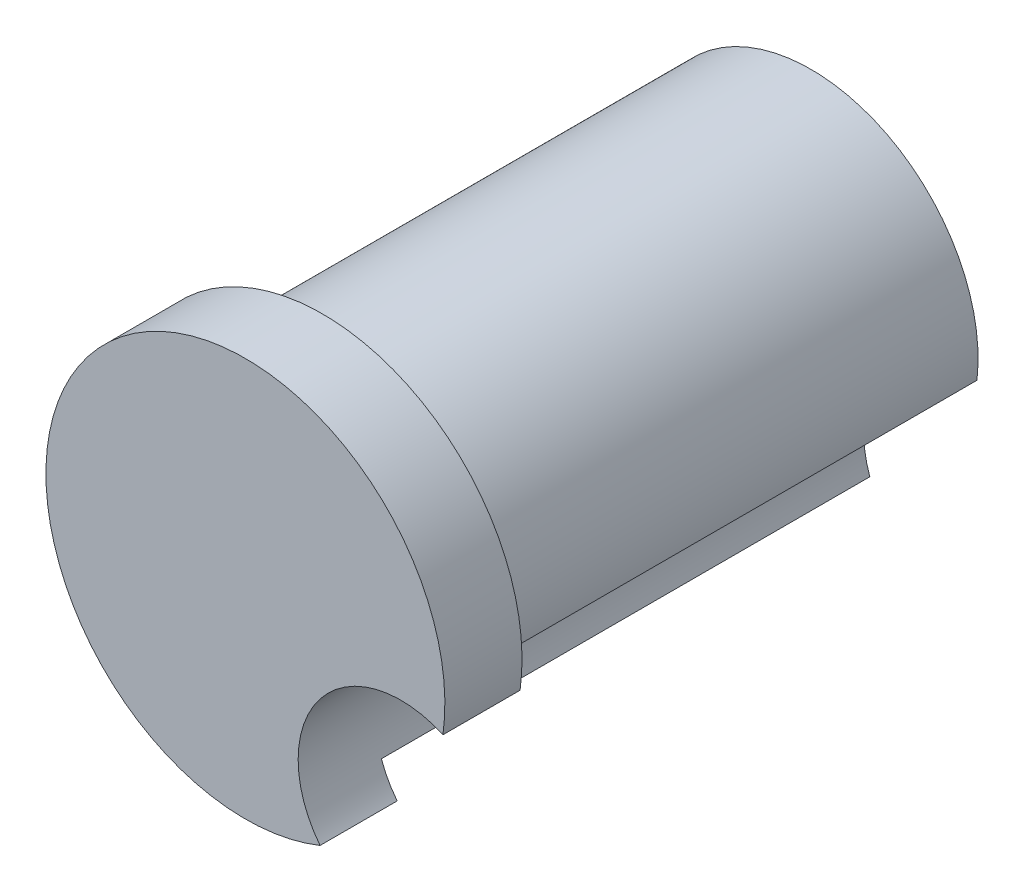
ISO-10303-21;
HEADER;
FILE_DESCRIPTION(('STEP AP214'),'2;1');
FILE_NAME('part.step','',(''),(''),'','','');
FILE_SCHEMA(('AUTOMOTIVE_DESIGN { 1 0 10303 214 1 1 1 1 }'));
ENDSEC;
DATA;
#1=APPLICATION_CONTEXT('core data for automotive mechanical design processes');
#2=APPLICATION_PROTOCOL_DEFINITION('international standard','automotive_design',2000,#1);
#3=PRODUCT_CONTEXT('',#1,'mechanical');
#4=PRODUCT('Part','Part','',(#3));
#5=PRODUCT_RELATED_PRODUCT_CATEGORY('part','',(#4));
#6=PRODUCT_DEFINITION_FORMATION('','',#4);
#7=PRODUCT_DEFINITION_CONTEXT('part definition',#1,'design');
#8=PRODUCT_DEFINITION('design','',#6,#7);
#9=PRODUCT_DEFINITION_SHAPE('','',#8);
#10=(LENGTH_UNIT() NAMED_UNIT(*) SI_UNIT(.MILLI.,.METRE.));
#11=(NAMED_UNIT(*) PLANE_ANGLE_UNIT() SI_UNIT($,.RADIAN.));
#12=(NAMED_UNIT(*) SI_UNIT($,.STERADIAN.) SOLID_ANGLE_UNIT());
#13=UNCERTAINTY_MEASURE_WITH_UNIT(LENGTH_MEASURE(1.E-05),#10,'distance_accuracy_value','');
#14=(GEOMETRIC_REPRESENTATION_CONTEXT(3) GLOBAL_UNCERTAINTY_ASSIGNED_CONTEXT((#13)) GLOBAL_UNIT_ASSIGNED_CONTEXT((#10,
#11,#12)) REPRESENTATION_CONTEXT('',''));
#15=CARTESIAN_POINT('',(0.,0.,0.));
#16=DIRECTION('',(0.,0.,1.));
#17=DIRECTION('',(1.,0.,0.));
#18=AXIS2_PLACEMENT_3D('',#15,#16,#17);
#19=CARTESIAN_POINT('',(10.31875,0.,0.));
#20=DIRECTION('',(0.,0.,-1.));
#21=DIRECTION('',(-1.,0.,0.));
#22=AXIS2_PLACEMENT_3D('',#19,#20,#21);
#23=PLANE('',#22);
#24=CARTESIAN_POINT('',(9.60742710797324,-7.50614470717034,0.));
#25=DIRECTION('',(0.,0.,-1.));
#26=DIRECTION('',(-1.,0.,0.));
#27=AXIS2_PLACEMENT_3D('',#24,#25,#26);
#28=CIRCLE('',#27,6.35);
#29=CARTESIAN_POINT('',(3.633145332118,-9.65799443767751,0.));
#30=VERTEX_POINT('',#29);
#31=CARTESIAN_POINT('',(10.2500481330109,-1.18874506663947,0.));
#32=VERTEX_POINT('',#31);
#33=EDGE_CURVE('E79',#30,#32,#28,.T.);
#34=ORIENTED_EDGE('',*,*,#33,.F.);
#35=CARTESIAN_POINT('',(0.,0.,0.));
#36=DIRECTION('',(0.,0.,1.));
#37=DIRECTION('',(1.,0.,0.));
#38=AXIS2_PLACEMENT_3D('',#35,#36,#37);
#39=CIRCLE('',#38,10.31875);
#40=EDGE_CURVE('E91',#32,#30,#39,.T.);
#41=ORIENTED_EDGE('',*,*,#40,.F.);
#42=EDGE_LOOP('',(#34,#41));
#43=FACE_BOUND('',#42,.T.);
#44=ADVANCED_FACE('F42',(#43),#23,.T.);
#45=CARTESIAN_POINT('',(0.,0.,34.925));
#46=DIRECTION('',(0.,0.,1.));
#47=DIRECTION('',(1.,0.,0.));
#48=AXIS2_PLACEMENT_3D('',#45,#46,#47);
#49=PLANE('',#48);
#50=CARTESIAN_POINT('',(9.60742710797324,-7.50614470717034,34.925));
#51=DIRECTION('',(0.,0.,-1.));
#52=DIRECTION('',(-1.,0.,0.));
#53=AXIS2_PLACEMENT_3D('',#50,#51,#52);
#54=CIRCLE('',#53,6.35);
#55=CARTESIAN_POINT('',(4.60988828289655,-11.4236829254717,34.925));
#56=VERTEX_POINT('',#55);
#57=CARTESIAN_POINT('',(12.1995836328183,-1.70931587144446,34.925));
#58=VERTEX_POINT('',#57);
#59=EDGE_CURVE('E86',#56,#58,#54,.T.);
#60=ORIENTED_EDGE('',*,*,#59,.T.);
#61=CARTESIAN_POINT('',(0.,0.,34.925));
#62=DIRECTION('',(0.,0.,1.));
#63=DIRECTION('',(1.,0.,0.));
#64=AXIS2_PLACEMENT_3D('',#61,#62,#63);
#65=CIRCLE('',#64,12.31875);
#66=EDGE_CURVE('E108',#58,#56,#65,.T.);
#67=ORIENTED_EDGE('',*,*,#66,.T.);
#68=EDGE_LOOP('',(#60,#67));
#69=FACE_BOUND('',#68,.T.);
#70=ADVANCED_FACE('F120',(#69),#49,.T.);
#71=CARTESIAN_POINT('',(0.,0.,34.925));
#72=DIRECTION('',(0.,0.,1.));
#73=DIRECTION('',(1.,0.,0.));
#74=AXIS2_PLACEMENT_3D('',#71,#72,#73);
#75=CYLINDRICAL_SURFACE('',#74,12.31875);
#76=DIRECTION('',(0.,0.,-1.));
#77=VECTOR('',#76,1.);
#78=CARTESIAN_POINT('',(12.1995836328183,-1.70931587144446,17.4625));
#79=LINE('',#78,#77);
#80=CARTESIAN_POINT('',(12.1995836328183,-1.70931587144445,30.1625));
#81=VERTEX_POINT('',#80);
#82=EDGE_CURVE('E95',#81,#58,#79,.F.);
#83=ORIENTED_EDGE('',*,*,#82,.F.);
#84=CARTESIAN_POINT('',(0.,0.,30.1625));
#85=DIRECTION('',(0.,0.,1.));
#86=DIRECTION('',(1.,0.,0.));
#87=AXIS2_PLACEMENT_3D('',#84,#85,#86);
#88=CIRCLE('',#87,12.31875);
#89=CARTESIAN_POINT('',(4.60988828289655,-11.4236829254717,30.1625));
#90=VERTEX_POINT('',#89);
#91=EDGE_CURVE('E100',#81,#90,#88,.T.);
#92=ORIENTED_EDGE('',*,*,#91,.T.);
#93=DIRECTION('',(0.,0.,-1.));
#94=VECTOR('',#93,1.);
#95=CARTESIAN_POINT('',(4.60988828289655,-11.4236829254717,17.4625));
#96=LINE('',#95,#94);
#97=EDGE_CURVE('E125',#56,#90,#96,.T.);
#98=ORIENTED_EDGE('',*,*,#97,.F.);
#99=ORIENTED_EDGE('',*,*,#66,.F.);
#100=EDGE_LOOP('',(#83,#92,#98,#99));
#101=FACE_BOUND('',#100,.T.);
#102=ADVANCED_FACE('F123',(#101),#75,.T.);
#103=CARTESIAN_POINT('',(12.31875,0.,30.1625));
#104=DIRECTION('',(0.,0.,-1.));
#105=DIRECTION('',(-1.,0.,0.));
#106=AXIS2_PLACEMENT_3D('',#103,#104,#105);
#107=PLANE('',#106);
#108=CARTESIAN_POINT('',(9.60742710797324,-7.50614470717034,30.1625));
#109=DIRECTION('',(0.,0.,-1.));
#110=DIRECTION('',(-1.,0.,0.));
#111=AXIS2_PLACEMENT_3D('',#108,#109,#110);
#112=CIRCLE('',#111,6.35);
#113=CARTESIAN_POINT('',(10.2500481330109,-1.18874506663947,30.1625));
#114=VERTEX_POINT('',#113);
#115=EDGE_CURVE('E63',#114,#81,#112,.T.);
#116=ORIENTED_EDGE('',*,*,#115,.F.);
#117=CARTESIAN_POINT('',(0.,0.,30.1625));
#118=DIRECTION('',(0.,0.,1.));
#119=DIRECTION('',(1.,0.,0.));
#120=AXIS2_PLACEMENT_3D('',#117,#118,#119);
#121=CIRCLE('',#120,10.31875);
#122=CARTESIAN_POINT('',(3.633145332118,-9.6579944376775,30.1625));
#123=VERTEX_POINT('',#122);
#124=EDGE_CURVE('E93',#114,#123,#121,.T.);
#125=ORIENTED_EDGE('',*,*,#124,.T.);
#126=EDGE_CURVE('E57',#90,#123,#112,.T.);
#127=ORIENTED_EDGE('',*,*,#126,.F.);
#128=ORIENTED_EDGE('',*,*,#91,.F.);
#129=EDGE_LOOP('',(#116,#125,#127,#128));
#130=FACE_BOUND('',#129,.T.);
#131=ADVANCED_FACE('F139',(#130),#107,.T.);
#132=CARTESIAN_POINT('',(0.,0.,34.925));
#133=DIRECTION('',(0.,0.,1.));
#134=DIRECTION('',(1.,0.,0.));
#135=AXIS2_PLACEMENT_3D('',#132,#133,#134);
#136=CYLINDRICAL_SURFACE('',#135,10.31875);
#137=DIRECTION('',(0.,0.,-1.));
#138=VECTOR('',#137,1.);
#139=CARTESIAN_POINT('',(10.2500481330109,-1.18874506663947,17.4625));
#140=LINE('',#139,#138);
#141=EDGE_CURVE('E11',#32,#114,#140,.F.);
#142=ORIENTED_EDGE('',*,*,#141,.F.);
#143=ORIENTED_EDGE('',*,*,#40,.T.);
#144=DIRECTION('',(0.,0.,-1.));
#145=VECTOR('',#144,1.);
#146=CARTESIAN_POINT('',(3.633145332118,-9.65799443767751,17.4625));
#147=LINE('',#146,#145);
#148=EDGE_CURVE('E50',#123,#30,#147,.T.);
#149=ORIENTED_EDGE('',*,*,#148,.F.);
#150=ORIENTED_EDGE('',*,*,#124,.F.);
#151=EDGE_LOOP('',(#142,#143,#149,#150));
#152=FACE_BOUND('',#151,.T.);
#153=ADVANCED_FACE('F90',(#152),#136,.T.);
#154=CARTESIAN_POINT('',(9.60742710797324,-7.50614470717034,34.925));
#155=DIRECTION('',(0.,0.,-1.));
#156=DIRECTION('',(-1.,0.,0.));
#157=AXIS2_PLACEMENT_3D('',#154,#155,#156);
#158=CYLINDRICAL_SURFACE('',#157,6.35);
#159=ORIENTED_EDGE('',*,*,#82,.T.);
#160=ORIENTED_EDGE('',*,*,#59,.F.);
#161=ORIENTED_EDGE('',*,*,#97,.T.);
#162=ORIENTED_EDGE('',*,*,#126,.T.);
#163=ORIENTED_EDGE('',*,*,#148,.T.);
#164=ORIENTED_EDGE('',*,*,#33,.T.);
#165=ORIENTED_EDGE('',*,*,#141,.T.);
#166=ORIENTED_EDGE('',*,*,#115,.T.);
#167=EDGE_LOOP('',(#159,#160,#161,#162,#163,#164,#165,#166));
#168=FACE_BOUND('',#167,.T.);
#169=ADVANCED_FACE('F81',(#168),#158,.F.);
#170=CLOSED_SHELL('',(#44,#70,#102,#131,#153,#169));
#171=MANIFOLD_SOLID_BREP('B2',#170);
#172=ADVANCED_BREP_SHAPE_REPRESENTATION('',(#18,#171),#14);
#173=SHAPE_DEFINITION_REPRESENTATION(#9,#172);
ENDSEC;
END-ISO-10303-21;
